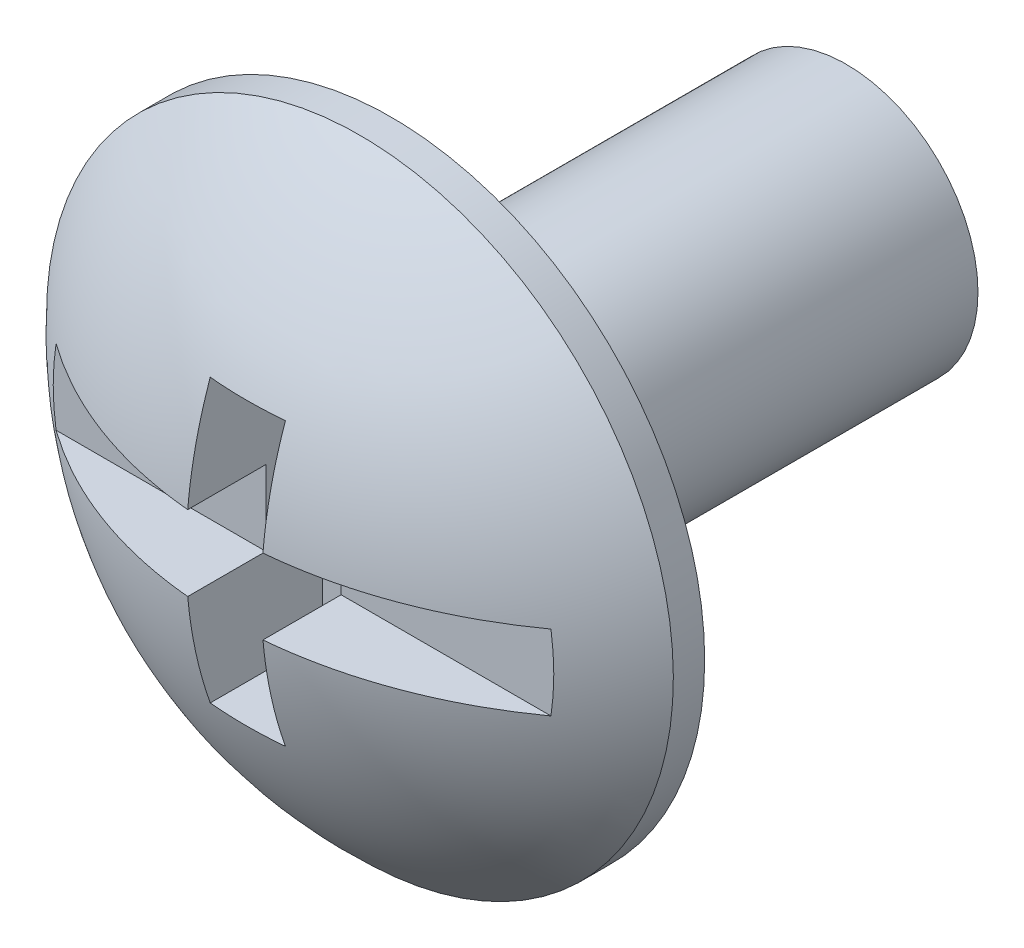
ISO-10303-21;
HEADER;
FILE_DESCRIPTION(('STEP AP214'),'2;1');
FILE_NAME('part.step','',(''),(''),'','','');
FILE_SCHEMA(('AUTOMOTIVE_DESIGN { 1 0 10303 214 1 1 1 1 }'));
ENDSEC;
DATA;
#1=APPLICATION_CONTEXT('core data for automotive mechanical design processes');
#2=APPLICATION_PROTOCOL_DEFINITION('international standard','automotive_design',2000,#1);
#3=PRODUCT_CONTEXT('',#1,'mechanical');
#4=PRODUCT('Part','Part','',(#3));
#5=PRODUCT_RELATED_PRODUCT_CATEGORY('part','',(#4));
#6=PRODUCT_DEFINITION_FORMATION('','',#4);
#7=PRODUCT_DEFINITION_CONTEXT('part definition',#1,'design');
#8=PRODUCT_DEFINITION('design','',#6,#7);
#9=PRODUCT_DEFINITION_SHAPE('','',#8);
#10=(LENGTH_UNIT() NAMED_UNIT(*) SI_UNIT(.MILLI.,.METRE.));
#11=(NAMED_UNIT(*) PLANE_ANGLE_UNIT() SI_UNIT($,.RADIAN.));
#12=(NAMED_UNIT(*) SI_UNIT($,.STERADIAN.) SOLID_ANGLE_UNIT());
#13=UNCERTAINTY_MEASURE_WITH_UNIT(LENGTH_MEASURE(1.E-05),#10,'distance_accuracy_value','');
#14=(GEOMETRIC_REPRESENTATION_CONTEXT(3) GLOBAL_UNCERTAINTY_ASSIGNED_CONTEXT((#13)) GLOBAL_UNIT_ASSIGNED_CONTEXT((#10,
#11,#12)) REPRESENTATION_CONTEXT('',''));
#15=CARTESIAN_POINT('',(0.,0.,0.));
#16=DIRECTION('',(0.,0.,1.));
#17=DIRECTION('',(1.,0.,0.));
#18=AXIS2_PLACEMENT_3D('',#15,#16,#17);
#19=CARTESIAN_POINT('',(-4.96386945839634,0.6,8.66));
#20=DIRECTION('',(0.,1.,0.));
#21=DIRECTION('',(0.,0.,1.));
#22=AXIS2_PLACEMENT_3D('',#19,#20,#21);
#23=PLANE('',#22);
#24=DIRECTION('',(-1.,0.,0.));
#25=VECTOR('',#24,1.);
#26=CARTESIAN_POINT('',(-4.96386945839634,0.6,8.66));
#27=LINE('',#26,#25);
#28=CARTESIAN_POINT('',(-0.6,0.6,8.66));
#29=VERTEX_POINT('',#28);
#30=CARTESIAN_POINT('',(-3.94749632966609,0.6,8.66));
#31=VERTEX_POINT('',#30);
#32=EDGE_CURVE('E141',#29,#31,#27,.T.);
#33=ORIENTED_EDGE('',*,*,#32,.F.);
#34=DIRECTION('',(0.,0.,1.));
#35=VECTOR('',#34,1.);
#36=CARTESIAN_POINT('',(-0.6,0.6,8.66));
#37=LINE('',#36,#35);
#38=CARTESIAN_POINT('',(-0.6,0.6,9.90670750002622));
#39=VERTEX_POINT('',#38);
#40=EDGE_CURVE('E132',#29,#39,#37,.T.);
#41=ORIENTED_EDGE('',*,*,#40,.T.);
#42=CARTESIAN_POINT('',(0.,0.6,3.17818181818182));
#43=DIRECTION('',(0.,1.,0.));
#44=DIRECTION('',(0.,0.,1.));
#45=AXIS2_PLACEMENT_3D('',#42,#43,#44);
#46=CIRCLE('',#45,6.75522448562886);
#47=EDGE_CURVE('E165',#39,#31,#46,.F.);
#48=ORIENTED_EDGE('',*,*,#47,.T.);
#49=EDGE_LOOP('',(#33,#41,#48));
#50=FACE_BOUND('',#49,.T.);
#51=ADVANCED_FACE('F17',(#50),#23,.F.);
#52=CARTESIAN_POINT('',(-4.96386945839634,-0.6,8.66));
#53=DIRECTION('',(0.,-1.,0.));
#54=DIRECTION('',(0.,0.,-1.));
#55=AXIS2_PLACEMENT_3D('',#52,#53,#54);
#56=PLANE('',#55);
#57=CARTESIAN_POINT('',(0.,-0.6,3.17818181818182));
#58=DIRECTION('',(0.,-1.,0.));
#59=DIRECTION('',(0.,0.,-1.));
#60=AXIS2_PLACEMENT_3D('',#57,#58,#59);
#61=CIRCLE('',#60,6.75522448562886);
#62=CARTESIAN_POINT('',(-3.94749632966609,-0.6,8.66));
#63=VERTEX_POINT('',#62);
#64=CARTESIAN_POINT('',(-0.6,-0.6,9.90670750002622));
#65=VERTEX_POINT('',#64);
#66=EDGE_CURVE('E162',#63,#65,#61,.F.);
#67=ORIENTED_EDGE('',*,*,#66,.T.);
#68=DIRECTION('',(0.,0.,-1.));
#69=VECTOR('',#68,1.);
#70=CARTESIAN_POINT('',(-0.6,-0.6,8.66));
#71=LINE('',#70,#69);
#72=CARTESIAN_POINT('',(-0.6,-0.6,8.66));
#73=VERTEX_POINT('',#72);
#74=EDGE_CURVE('E129',#65,#73,#71,.T.);
#75=ORIENTED_EDGE('',*,*,#74,.T.);
#76=DIRECTION('',(1.,0.,0.));
#77=VECTOR('',#76,1.);
#78=CARTESIAN_POINT('',(-4.96386945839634,-0.6,8.66));
#79=LINE('',#78,#77);
#80=EDGE_CURVE('E138',#63,#73,#79,.T.);
#81=ORIENTED_EDGE('',*,*,#80,.F.);
#82=EDGE_LOOP('',(#67,#75,#81));
#83=FACE_BOUND('',#82,.T.);
#84=ADVANCED_FACE('F200',(#83),#56,.F.);
#85=CARTESIAN_POINT('',(0.,0.,8.66));
#86=DIRECTION('',(0.,0.,1.));
#87=DIRECTION('',(1.,0.,0.));
#88=AXIS2_PLACEMENT_3D('',#85,#86,#87);
#89=PLANE('',#88);
#90=DIRECTION('',(0.,-1.,0.));
#91=VECTOR('',#90,1.);
#92=CARTESIAN_POINT('',(-0.6,0.,8.66));
#93=LINE('',#92,#91);
#94=EDGE_CURVE('E171',#29,#73,#93,.T.);
#95=ORIENTED_EDGE('',*,*,#94,.F.);
#96=ORIENTED_EDGE('',*,*,#32,.T.);
#97=CARTESIAN_POINT('',(0.,0.,8.66));
#98=DIRECTION('',(0.,0.,1.));
#99=DIRECTION('',(1.,0.,0.));
#100=AXIS2_PLACEMENT_3D('',#97,#98,#99);
#101=CIRCLE('',#100,3.99283449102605);
#102=EDGE_CURVE('E161',#63,#31,#101,.F.);
#103=ORIENTED_EDGE('',*,*,#102,.F.);
#104=ORIENTED_EDGE('',*,*,#80,.T.);
#105=EDGE_LOOP('',(#95,#96,#103,#104));
#106=FACE_BOUND('',#105,.T.);
#107=ADVANCED_FACE('F210',(#106),#89,.T.);
#108=CARTESIAN_POINT('',(0.,0.,3.17818181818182));
#109=DIRECTION('',(0.,0.,-1.));
#110=DIRECTION('',(1.,0.,0.));
#111=AXIS2_PLACEMENT_3D('',#108,#109,#110);
#112=SPHERICAL_SURFACE('',#111,6.78181818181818);
#113=CARTESIAN_POINT('',(-0.6,0.,3.17818181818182));
#114=DIRECTION('',(-1.,0.,0.));
#115=DIRECTION('',(0.,-1.,0.));
#116=AXIS2_PLACEMENT_3D('',#113,#114,#115);
#117=CIRCLE('',#116,6.75522448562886);
#118=CARTESIAN_POINT('',(-0.6,-2.25,9.54768398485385));
#119=VERTEX_POINT('',#118);
#120=EDGE_CURVE('E135',#65,#119,#117,.F.);
#121=ORIENTED_EDGE('',*,*,#120,.F.);
#122=ORIENTED_EDGE('',*,*,#66,.F.);
#123=ORIENTED_EDGE('',*,*,#102,.T.);
#124=ORIENTED_EDGE('',*,*,#47,.F.);
#125=CARTESIAN_POINT('',(-0.6,2.25,9.54768398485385));
#126=VERTEX_POINT('',#125);
#127=EDGE_CURVE('E137',#126,#39,#117,.F.);
#128=ORIENTED_EDGE('',*,*,#127,.F.);
#129=CARTESIAN_POINT('',(0.,2.25,3.17818181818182));
#130=DIRECTION('',(0.,1.,0.));
#131=DIRECTION('',(0.,0.,1.));
#132=AXIS2_PLACEMENT_3D('',#129,#130,#131);
#133=CIRCLE('',#132,6.3976994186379);
#134=CARTESIAN_POINT('',(0.6,2.25,9.54768398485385));
#135=VERTEX_POINT('',#134);
#136=EDGE_CURVE('E25',#135,#126,#133,.F.);
#137=ORIENTED_EDGE('',*,*,#136,.F.);
#138=CARTESIAN_POINT('',(0.6,0.,3.17818181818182));
#139=DIRECTION('',(1.,0.,0.));
#140=DIRECTION('',(0.,1.,0.));
#141=AXIS2_PLACEMENT_3D('',#138,#139,#140);
#142=CIRCLE('',#141,6.75522448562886);
#143=CARTESIAN_POINT('',(0.6,0.6,9.90670750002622));
#144=VERTEX_POINT('',#143);
#145=EDGE_CURVE('E113',#144,#135,#142,.F.);
#146=ORIENTED_EDGE('',*,*,#145,.F.);
#147=CARTESIAN_POINT('',(3.94749632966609,0.6,8.66));
#148=VERTEX_POINT('',#147);
#149=EDGE_CURVE('E166',#148,#144,#46,.F.);
#150=ORIENTED_EDGE('',*,*,#149,.F.);
#151=CARTESIAN_POINT('',(3.94749632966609,-0.6,8.66));
#152=VERTEX_POINT('',#151);
#153=EDGE_CURVE('E158',#148,#152,#101,.F.);
#154=ORIENTED_EDGE('',*,*,#153,.T.);
#155=CARTESIAN_POINT('',(0.6,-0.6,9.90670750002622));
#156=VERTEX_POINT('',#155);
#157=EDGE_CURVE('E39',#156,#152,#61,.F.);
#158=ORIENTED_EDGE('',*,*,#157,.F.);
#159=CARTESIAN_POINT('',(0.6,-2.25,9.54768398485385));
#160=VERTEX_POINT('',#159);
#161=EDGE_CURVE('E128',#160,#156,#142,.F.);
#162=ORIENTED_EDGE('',*,*,#161,.F.);
#163=CARTESIAN_POINT('',(0.,-2.25,3.17818181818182));
#164=DIRECTION('',(0.,-1.,0.));
#165=DIRECTION('',(0.,0.,-1.));
#166=AXIS2_PLACEMENT_3D('',#163,#164,#165);
#167=CIRCLE('',#166,6.3976994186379);
#168=EDGE_CURVE('E12',#119,#160,#167,.F.);
#169=ORIENTED_EDGE('',*,*,#168,.F.);
#170=EDGE_LOOP('',(#121,#122,#123,#124,#128,#137,#146,#150,#154,#158,#162,#169));
#171=FACE_BOUND('',#170,.T.);
#172=CARTESIAN_POINT('',(0.,0.,7.76));
#173=DIRECTION('',(0.,0.,-1.));
#174=DIRECTION('',(-1.,0.,0.));
#175=AXIS2_PLACEMENT_3D('',#172,#173,#174);
#176=CIRCLE('',#175,5.);
#177=CARTESIAN_POINT('',(-5.,0.,7.76));
#178=VERTEX_POINT('',#177);
#179=EDGE_CURVE('E146',#178,#178,#176,.T.);
#180=ORIENTED_EDGE('',*,*,#179,.F.);
#181=EDGE_LOOP('',(#180));
#182=FACE_BOUND('',#181,.T.);
#183=ADVANCED_FACE('F180',(#171,#182),#112,.T.);
#184=CARTESIAN_POINT('',(0.,0.,9.96));
#185=DIRECTION('',(0.,0.,-1.));
#186=DIRECTION('',(-1.,0.,0.));
#187=AXIS2_PLACEMENT_3D('',#184,#185,#186);
#188=CYLINDRICAL_SURFACE('',#187,5.);
#189=CARTESIAN_POINT('',(0.,0.,7.26));
#190=DIRECTION('',(0.,0.,1.));
#191=DIRECTION('',(1.,0.,0.));
#192=AXIS2_PLACEMENT_3D('',#189,#190,#191);
#193=CIRCLE('',#192,5.);
#194=CARTESIAN_POINT('',(5.,0.,7.26));
#195=VERTEX_POINT('',#194);
#196=EDGE_CURVE('E149',#195,#195,#193,.T.);
#197=ORIENTED_EDGE('',*,*,#196,.T.);
#198=EDGE_LOOP('',(#197));
#199=FACE_BOUND('',#198,.T.);
#200=ORIENTED_EDGE('',*,*,#179,.T.);
#201=EDGE_LOOP('',(#200));
#202=FACE_BOUND('',#201,.T.);
#203=ADVANCED_FACE('F306',(#199,#202),#188,.T.);
#204=CARTESIAN_POINT('',(0.,0.,7.26));
#205=DIRECTION('',(0.,0.,-1.));
#206=DIRECTION('',(-1.,0.,0.));
#207=AXIS2_PLACEMENT_3D('',#204,#205,#206);
#208=CYLINDRICAL_SURFACE('',#207,2.1);
#209=CARTESIAN_POINT('',(0.,0.,7.26));
#210=DIRECTION('',(0.,0.,1.));
#211=DIRECTION('',(1.,0.,0.));
#212=AXIS2_PLACEMENT_3D('',#209,#210,#211);
#213=CIRCLE('',#212,2.1);
#214=CARTESIAN_POINT('',(2.1,0.,7.26));
#215=VERTEX_POINT('',#214);
#216=EDGE_CURVE('E155',#215,#215,#213,.T.);
#217=ORIENTED_EDGE('',*,*,#216,.F.);
#218=EDGE_LOOP('',(#217));
#219=FACE_BOUND('',#218,.T.);
#220=CARTESIAN_POINT('',(0.,0.,0.));
#221=DIRECTION('',(0.,0.,1.));
#222=DIRECTION('',(1.,0.,0.));
#223=AXIS2_PLACEMENT_3D('',#220,#221,#222);
#224=CIRCLE('',#223,2.1);
#225=CARTESIAN_POINT('',(2.1,0.,0.));
#226=VERTEX_POINT('',#225);
#227=EDGE_CURVE('E152',#226,#226,#224,.T.);
#228=ORIENTED_EDGE('',*,*,#227,.T.);
#229=EDGE_LOOP('',(#228));
#230=FACE_BOUND('',#229,.T.);
#231=ADVANCED_FACE('F19',(#219,#230),#208,.T.);
#232=CARTESIAN_POINT('',(0.,0.,0.));
#233=DIRECTION('',(0.,0.,1.));
#234=DIRECTION('',(1.,0.,0.));
#235=AXIS2_PLACEMENT_3D('',#232,#233,#234);
#236=PLANE('',#235);
#237=ORIENTED_EDGE('',*,*,#227,.F.);
#238=EDGE_LOOP('',(#237));
#239=FACE_BOUND('',#238,.T.);
#240=ADVANCED_FACE('F201',(#239),#236,.F.);
#241=CARTESIAN_POINT('',(0.,0.,7.26));
#242=DIRECTION('',(0.,0.,1.));
#243=DIRECTION('',(1.,0.,0.));
#244=AXIS2_PLACEMENT_3D('',#241,#242,#243);
#245=PLANE('',#244);
#246=ORIENTED_EDGE('',*,*,#196,.F.);
#247=EDGE_LOOP('',(#246));
#248=FACE_BOUND('',#247,.T.);
#249=ORIENTED_EDGE('',*,*,#216,.T.);
#250=EDGE_LOOP('',(#249));
#251=FACE_BOUND('',#250,.T.);
#252=ADVANCED_FACE('F192',(#248,#251),#245,.F.);
#253=ORIENTED_EDGE('',*,*,#149,.T.);
#254=DIRECTION('',(0.,0.,-1.));
#255=VECTOR('',#254,1.);
#256=CARTESIAN_POINT('',(0.6,0.6,8.66));
#257=LINE('',#256,#255);
#258=CARTESIAN_POINT('',(0.6,0.6,8.66));
#259=VERTEX_POINT('',#258);
#260=EDGE_CURVE('E120',#144,#259,#257,.T.);
#261=ORIENTED_EDGE('',*,*,#260,.T.);
#262=EDGE_CURVE('E143',#148,#259,#27,.T.);
#263=ORIENTED_EDGE('',*,*,#262,.F.);
#264=EDGE_LOOP('',(#253,#261,#263));
#265=FACE_BOUND('',#264,.T.);
#266=ADVANCED_FACE('F189',(#265),#23,.F.);
#267=CARTESIAN_POINT('',(0.6,-0.6,8.66));
#268=VERTEX_POINT('',#267);
#269=EDGE_CURVE('E142',#268,#152,#79,.T.);
#270=ORIENTED_EDGE('',*,*,#269,.F.);
#271=DIRECTION('',(0.,0.,1.));
#272=VECTOR('',#271,1.);
#273=CARTESIAN_POINT('',(0.6,-0.6,8.66));
#274=LINE('',#273,#272);
#275=EDGE_CURVE('E32',#268,#156,#274,.T.);
#276=ORIENTED_EDGE('',*,*,#275,.T.);
#277=ORIENTED_EDGE('',*,*,#157,.T.);
#278=EDGE_LOOP('',(#270,#276,#277));
#279=FACE_BOUND('',#278,.T.);
#280=ADVANCED_FACE('F191',(#279),#56,.F.);
#281=DIRECTION('',(0.,1.,0.));
#282=VECTOR('',#281,1.);
#283=CARTESIAN_POINT('',(0.6,0.,8.66));
#284=LINE('',#283,#282);
#285=EDGE_CURVE('E169',#268,#259,#284,.T.);
#286=ORIENTED_EDGE('',*,*,#285,.F.);
#287=ORIENTED_EDGE('',*,*,#269,.T.);
#288=ORIENTED_EDGE('',*,*,#153,.F.);
#289=ORIENTED_EDGE('',*,*,#262,.T.);
#290=EDGE_LOOP('',(#286,#287,#288,#289));
#291=FACE_BOUND('',#290,.T.);
#292=ADVANCED_FACE('F184',(#291),#89,.T.);
#293=CARTESIAN_POINT('',(-0.6,-2.25,2.60274759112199));
#294=DIRECTION('',(0.,-1.,0.));
#295=DIRECTION('',(0.,0.,-1.));
#296=AXIS2_PLACEMENT_3D('',#293,#294,#295);
#297=PLANE('',#296);
#298=ORIENTED_EDGE('',*,*,#168,.T.);
#299=DIRECTION('',(0.,0.,1.));
#300=VECTOR('',#299,1.);
#301=CARTESIAN_POINT('',(0.6,-2.25,2.60274759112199));
#302=LINE('',#301,#300);
#303=CARTESIAN_POINT('',(0.6,-2.25,7.76));
#304=VERTEX_POINT('',#303);
#305=EDGE_CURVE('E114',#304,#160,#302,.T.);
#306=ORIENTED_EDGE('',*,*,#305,.F.);
#307=DIRECTION('',(-1.,0.,0.));
#308=VECTOR('',#307,1.);
#309=CARTESIAN_POINT('',(-0.6,-2.25,7.76));
#310=LINE('',#309,#308);
#311=CARTESIAN_POINT('',(-0.6,-2.25,7.76));
#312=VERTEX_POINT('',#311);
#313=EDGE_CURVE('E117',#304,#312,#310,.T.);
#314=ORIENTED_EDGE('',*,*,#313,.T.);
#315=DIRECTION('',(0.,0.,1.));
#316=VECTOR('',#315,1.);
#317=CARTESIAN_POINT('',(-0.6,-2.25,2.60274759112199));
#318=LINE('',#317,#316);
#319=EDGE_CURVE('E106',#312,#119,#318,.T.);
#320=ORIENTED_EDGE('',*,*,#319,.T.);
#321=EDGE_LOOP('',(#298,#306,#314,#320));
#322=FACE_BOUND('',#321,.T.);
#323=ADVANCED_FACE('F221',(#322),#297,.F.);
#324=CARTESIAN_POINT('',(-0.6,2.25,2.60274759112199));
#325=DIRECTION('',(-1.,0.,0.));
#326=DIRECTION('',(0.,-1.,0.));
#327=AXIS2_PLACEMENT_3D('',#324,#325,#326);
#328=PLANE('',#327);
#329=ORIENTED_EDGE('',*,*,#127,.T.);
#330=ORIENTED_EDGE('',*,*,#40,.F.);
#331=ORIENTED_EDGE('',*,*,#94,.T.);
#332=ORIENTED_EDGE('',*,*,#74,.F.);
#333=ORIENTED_EDGE('',*,*,#120,.T.);
#334=ORIENTED_EDGE('',*,*,#319,.F.);
#335=DIRECTION('',(0.,1.,0.));
#336=VECTOR('',#335,1.);
#337=CARTESIAN_POINT('',(-0.6,2.25,7.76));
#338=LINE('',#337,#336);
#339=CARTESIAN_POINT('',(-0.6,2.25,7.76));
#340=VERTEX_POINT('',#339);
#341=EDGE_CURVE('E105',#312,#340,#338,.T.);
#342=ORIENTED_EDGE('',*,*,#341,.T.);
#343=DIRECTION('',(0.,0.,1.));
#344=VECTOR('',#343,1.);
#345=CARTESIAN_POINT('',(-0.6,2.25,2.60274759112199));
#346=LINE('',#345,#344);
#347=EDGE_CURVE('E101',#340,#126,#346,.T.);
#348=ORIENTED_EDGE('',*,*,#347,.T.);
#349=EDGE_LOOP('',(#329,#330,#331,#332,#333,#334,#342,#348));
#350=FACE_BOUND('',#349,.T.);
#351=ADVANCED_FACE('F175',(#350),#328,.F.);
#352=CARTESIAN_POINT('',(-0.6,2.25,2.60274759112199));
#353=DIRECTION('',(0.,1.,0.));
#354=DIRECTION('',(0.,0.,1.));
#355=AXIS2_PLACEMENT_3D('',#352,#353,#354);
#356=PLANE('',#355);
#357=ORIENTED_EDGE('',*,*,#136,.T.);
#358=ORIENTED_EDGE('',*,*,#347,.F.);
#359=DIRECTION('',(1.,0.,0.));
#360=VECTOR('',#359,1.);
#361=CARTESIAN_POINT('',(-0.6,2.25,7.76));
#362=LINE('',#361,#360);
#363=CARTESIAN_POINT('',(0.6,2.25,7.76));
#364=VERTEX_POINT('',#363);
#365=EDGE_CURVE('E95',#340,#364,#362,.T.);
#366=ORIENTED_EDGE('',*,*,#365,.T.);
#367=DIRECTION('',(0.,0.,1.));
#368=VECTOR('',#367,1.);
#369=CARTESIAN_POINT('',(0.6,2.25,2.60274759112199));
#370=LINE('',#369,#368);
#371=EDGE_CURVE('E98',#364,#135,#370,.T.);
#372=ORIENTED_EDGE('',*,*,#371,.T.);
#373=EDGE_LOOP('',(#357,#358,#366,#372));
#374=FACE_BOUND('',#373,.T.);
#375=ADVANCED_FACE('F97',(#374),#356,.F.);
#376=CARTESIAN_POINT('',(0.6,2.25,2.60274759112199));
#377=DIRECTION('',(1.,0.,0.));
#378=DIRECTION('',(0.,1.,0.));
#379=AXIS2_PLACEMENT_3D('',#376,#377,#378);
#380=PLANE('',#379);
#381=ORIENTED_EDGE('',*,*,#161,.T.);
#382=ORIENTED_EDGE('',*,*,#275,.F.);
#383=ORIENTED_EDGE('',*,*,#285,.T.);
#384=ORIENTED_EDGE('',*,*,#260,.F.);
#385=ORIENTED_EDGE('',*,*,#145,.T.);
#386=ORIENTED_EDGE('',*,*,#371,.F.);
#387=DIRECTION('',(0.,-1.,0.));
#388=VECTOR('',#387,1.);
#389=CARTESIAN_POINT('',(0.6,2.25,7.76));
#390=LINE('',#389,#388);
#391=EDGE_CURVE('E110',#364,#304,#390,.T.);
#392=ORIENTED_EDGE('',*,*,#391,.T.);
#393=ORIENTED_EDGE('',*,*,#305,.T.);
#394=EDGE_LOOP('',(#381,#382,#383,#384,#385,#386,#392,#393));
#395=FACE_BOUND('',#394,.T.);
#396=ADVANCED_FACE('F108',(#395),#380,.F.);
#397=CARTESIAN_POINT('',(0.,0.,7.76));
#398=DIRECTION('',(0.,0.,1.));
#399=DIRECTION('',(1.,0.,0.));
#400=AXIS2_PLACEMENT_3D('',#397,#398,#399);
#401=PLANE('',#400);
#402=ORIENTED_EDGE('',*,*,#313,.F.);
#403=ORIENTED_EDGE('',*,*,#391,.F.);
#404=ORIENTED_EDGE('',*,*,#365,.F.);
#405=ORIENTED_EDGE('',*,*,#341,.F.);
#406=EDGE_LOOP('',(#402,#403,#404,#405));
#407=FACE_BOUND('',#406,.T.);
#408=ADVANCED_FACE('F116',(#407),#401,.T.);
#409=CLOSED_SHELL('',(#51,#84,#107,#183,#203,#231,#240,#252,#266,#280,#292,#323,#351,#375,#396,#408));
#410=MANIFOLD_SOLID_BREP('B1',#409);
#411=ADVANCED_BREP_SHAPE_REPRESENTATION('',(#18,#410),#14);
#412=SHAPE_DEFINITION_REPRESENTATION(#9,#411);
ENDSEC;
END-ISO-10303-21;
